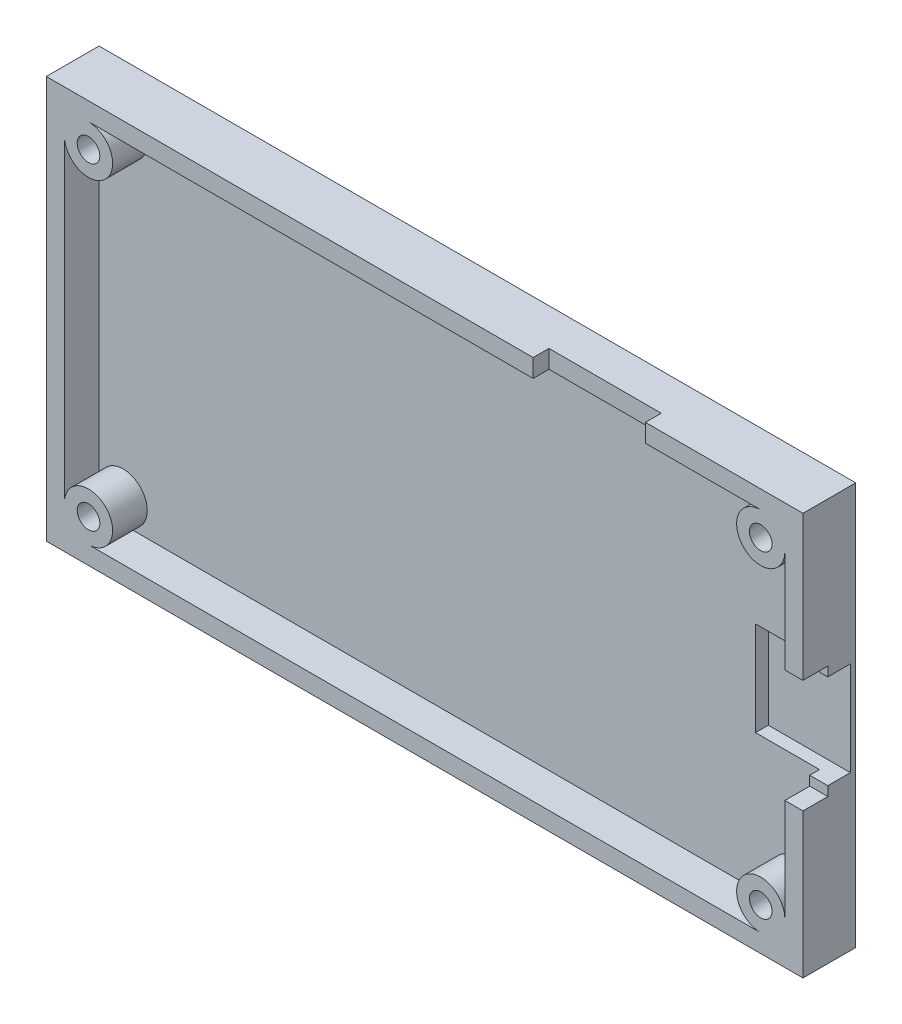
from build123d import *

# Parameters (mm, degrees)
SKETCH_1_W          = 95.6
SKETCH_1_H          = 48.6
EXTRUDE_1_DEPTH     = 2.4
SKETCH_1_3_W        = 100.4
SKETCH_1_3_H        = 53.4
SKETCH_1_3_W_2      = 95.6
SKETCH_1_3_H_2      = 48.6
EXTRUDE_2_DEPTH     = 7
SKETCH_2_R          = 1.5
EXTRUDE_3_DEPTH     = 4.6
SKETCH_3_W          = 4.832451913
SKETCH_3_H          = 15
CUT_EXTRUDE_1_DEPTH = 3.3
SKETCH_4_W          = 12.939984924
SKETCH_4_H          = 12.5
CUT_EXTRUDE_2_DEPTH = 3
SKETCH_5_W          = 14.9
SKETCH_5_H          = 6.786707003
CUT_EXTRUDE_3_DEPTH = 2.1


with BuildPart() as part:
    # Sketch 1 → Extrude 1 (new body)
    with BuildSketch(Plane.XY):
        Rectangle(SKETCH_1_W, SKETCH_1_H)
    extrude(amount=EXTRUDE_1_DEPTH)

    # Sketch 1_3 → Extrude 2 (add)
    with BuildSketch(Plane.XY):
        Rectangle(SKETCH_1_3_W, SKETCH_1_3_H)
        Rectangle(SKETCH_1_3_W_2, SKETCH_1_3_H_2, mode=Mode.SUBTRACT)
    extrude(amount=EXTRUDE_2_DEPTH)

    # Sketch 2 → Extrude 3 (add)
    # profile 1 of 4: a face of its own
    with BuildSketch(Plane.XY.offset(2.4)):
        with BuildLine():
            Line((-44.6, 24.3), (-47.8, 24.3))
            Line((-47.8, 24.3), (-47.8, 21.1))
            ThreePointArc((-47.8, 21.1), (-42.3372583, 18.8372583), (-44.6, 24.3))
        make_face()
        with Locations(Location((-44.6, 21.1, 0), (0, 0, 180))):
            Circle(SKETCH_2_R, mode=Mode.SUBTRACT)
    # profile 2 of 4: a face of its own
    with BuildSketch(Plane.XY.offset(2.4)):
        with BuildLine():
            Line((44.6, 24.3), (47.8, 24.3))
            Line((47.8, 24.3), (47.8, 21.1))
            ThreePointArc((47.8, 21.1), (42.3372583, 18.8372583), (44.6, 24.3))
        make_face()
        with Locations(Location((44.6, 21.1, 0), (0, 0, 180))):
            Circle(SKETCH_2_R, mode=Mode.SUBTRACT)
    # profile 3 of 4: a face of its own
    with BuildSketch(Plane.XY.offset(2.4)):
        with BuildLine():
            Line((47.8, -24.3), (47.8, -21.1))
            ThreePointArc((47.8, -21.1), (42.3372583, -18.8372583), (44.6, -24.3))
            Line((44.6, -24.3), (47.8, -24.3))
        make_face()
        with Locations(Location((44.6, -21.1, 0), (0, 0, 180))):
            Circle(SKETCH_2_R, mode=Mode.SUBTRACT)
    # profile 4 of 4: a face of its own
    with BuildSketch(Plane.XY.offset(2.4)):
        with BuildLine():
            Line((-44.6, -24.3), (-47.8, -24.3))
            Line((-47.8, -24.3), (-47.8, -21.1))
            ThreePointArc((-47.8, -21.1), (-42.3372583, -18.8372583), (-44.6, -24.3))
        make_face()
        with Locations(Location((-44.6, -21.1, 0), (0, 0, 180))):
            Circle(SKETCH_2_R, mode=Mode.SUBTRACT)
    extrude(amount=EXTRUDE_3_DEPTH)

    # Sketch 3 → Cut-Extrude 1 (cut)
    with BuildSketch(Plane.XY.offset(7)):
        with Locations((48.99434883, 0)):
            Rectangle(SKETCH_3_W, SKETCH_3_H)
    extrude(amount=-CUT_EXTRUDE_1_DEPTH, mode=Mode.SUBTRACT)

    # Sketch 4 → Cut-Extrude 2 (cut)
    with BuildSketch(Plane.XY.offset(3.7)):
        with Locations((45.769992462, 0)):
            Rectangle(SKETCH_4_W, SKETCH_4_H)
    extrude(amount=-CUT_EXTRUDE_2_DEPTH, mode=Mode.SUBTRACT)

    # Sketch 5 → Cut-Extrude 3 (cut)
    with BuildSketch(Plane.XY.offset(7)):
        with Locations((21.85, 25.369386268)):
            Rectangle(SKETCH_5_W, SKETCH_5_H)
    extrude(amount=-CUT_EXTRUDE_3_DEPTH, mode=Mode.SUBTRACT)


solid = part.part
